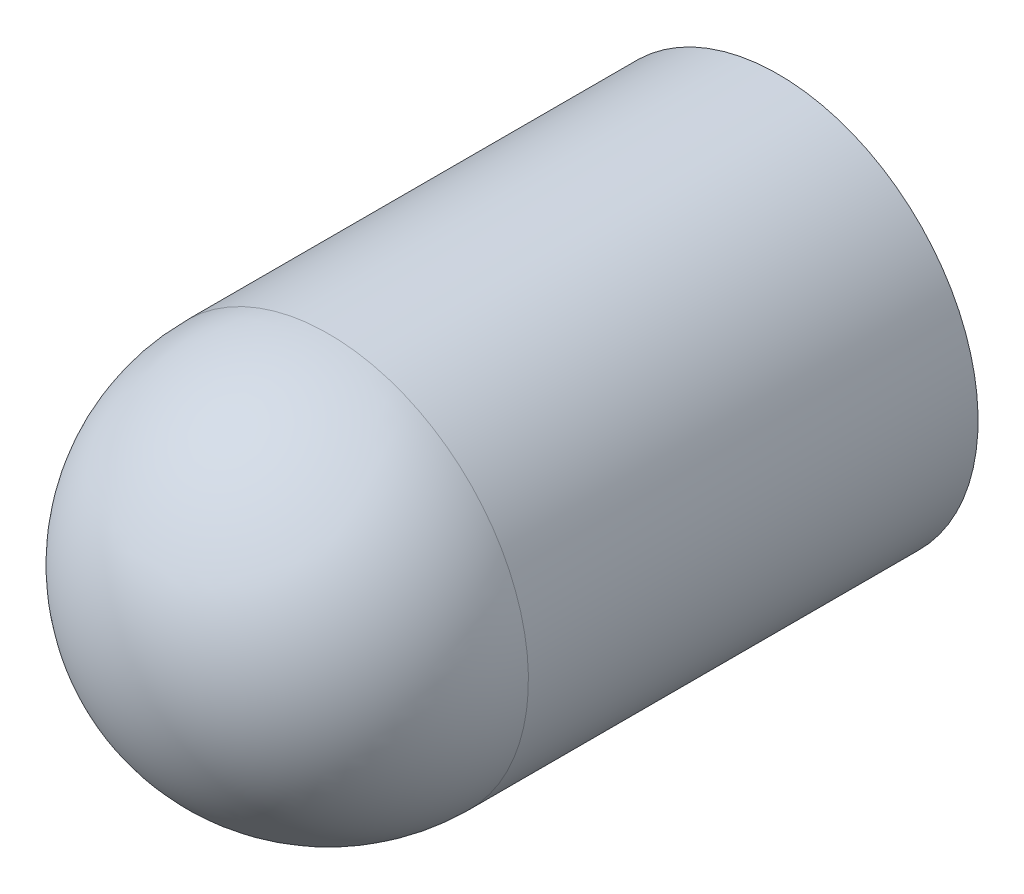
ISO-10303-21;
HEADER;
FILE_DESCRIPTION(('STEP AP214'),'2;1');
FILE_NAME('part.step','',(''),(''),'','','');
FILE_SCHEMA(('AUTOMOTIVE_DESIGN { 1 0 10303 214 1 1 1 1 }'));
ENDSEC;
DATA;
#1=APPLICATION_CONTEXT('core data for automotive mechanical design processes');
#2=APPLICATION_PROTOCOL_DEFINITION('international standard','automotive_design',2000,#1);
#3=PRODUCT_CONTEXT('',#1,'mechanical');
#4=PRODUCT('Part','Part','',(#3));
#5=PRODUCT_RELATED_PRODUCT_CATEGORY('part','',(#4));
#6=PRODUCT_DEFINITION_FORMATION('','',#4);
#7=PRODUCT_DEFINITION_CONTEXT('part definition',#1,'design');
#8=PRODUCT_DEFINITION('design','',#6,#7);
#9=PRODUCT_DEFINITION_SHAPE('','',#8);
#10=(LENGTH_UNIT() NAMED_UNIT(*) SI_UNIT(.MILLI.,.METRE.));
#11=(NAMED_UNIT(*) PLANE_ANGLE_UNIT() SI_UNIT($,.RADIAN.));
#12=(NAMED_UNIT(*) SI_UNIT($,.STERADIAN.) SOLID_ANGLE_UNIT());
#13=UNCERTAINTY_MEASURE_WITH_UNIT(LENGTH_MEASURE(1.E-05),#10,'distance_accuracy_value','');
#14=(GEOMETRIC_REPRESENTATION_CONTEXT(3) GLOBAL_UNCERTAINTY_ASSIGNED_CONTEXT((#13)) GLOBAL_UNIT_ASSIGNED_CONTEXT((#10,
#11,#12)) REPRESENTATION_CONTEXT('',''));
#15=CARTESIAN_POINT('',(0.,0.,0.));
#16=DIRECTION('',(0.,0.,1.));
#17=DIRECTION('',(1.,0.,0.));
#18=AXIS2_PLACEMENT_3D('',#15,#16,#17);
#19=CARTESIAN_POINT('',(0.,0.,7.12));
#20=DIRECTION('',(0.,0.,-1.));
#21=DIRECTION('',(-0.500084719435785,0.865976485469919,0.));
#22=AXIS2_PLACEMENT_3D('',#19,#20,#21);
#23=CYLINDRICAL_SURFACE('',#22,4.);
#24=CARTESIAN_POINT('',(0.,0.,3.12));
#25=DIRECTION('',(0.,0.,1.));
#26=DIRECTION('',(-0.500084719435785,0.865976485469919,0.));
#27=AXIS2_PLACEMENT_3D('',#24,#25,#26);
#28=CIRCLE('',#27,4.);
#29=CARTESIAN_POINT('',(-2.00033887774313,3.46390594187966,3.12));
#30=VERTEX_POINT('',#29);
#31=EDGE_CURVE('E10',#30,#30,#28,.T.);
#32=ORIENTED_EDGE('',*,*,#31,.F.);
#33=EDGE_LOOP('',(#32));
#34=FACE_BOUND('',#33,.T.);
#35=CARTESIAN_POINT('',(0.,0.,-5.88));
#36=DIRECTION('',(0.,0.,1.));
#37=DIRECTION('',(-0.500084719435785,0.865976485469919,0.));
#38=AXIS2_PLACEMENT_3D('',#35,#36,#37);
#39=CIRCLE('',#38,4.);
#40=CARTESIAN_POINT('',(-2.00033887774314,3.46390594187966,-5.88));
#41=VERTEX_POINT('',#40);
#42=EDGE_CURVE('E52',#41,#41,#39,.T.);
#43=ORIENTED_EDGE('',*,*,#42,.T.);
#44=EDGE_LOOP('',(#43));
#45=FACE_BOUND('',#44,.T.);
#46=ADVANCED_FACE('F15',(#34,#45),#23,.T.);
#47=CARTESIAN_POINT('',(0.,0.,3.12));
#48=DIRECTION('',(0.,0.,1.));
#49=DIRECTION('',(0.500084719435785,-0.865976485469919,0.));
#50=AXIS2_PLACEMENT_3D('',#47,#48,#49);
#51=SPHERICAL_SURFACE('',#50,4.);
#52=ORIENTED_EDGE('',*,*,#31,.T.);
#53=EDGE_LOOP('',(#52));
#54=FACE_BOUND('',#53,.T.);
#55=ADVANCED_FACE('F17',(#54),#51,.T.);
#56=CARTESIAN_POINT('',(0.,0.,-5.88));
#57=DIRECTION('',(0.,0.,-1.));
#58=DIRECTION('',(0.500084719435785,-0.865976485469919,0.));
#59=AXIS2_PLACEMENT_3D('',#56,#57,#58);
#60=CYLINDRICAL_SURFACE('',#59,2.5);
#61=CARTESIAN_POINT('',(0.,0.,-5.38));
#62=DIRECTION('',(0.,0.,-1.));
#63=DIRECTION('',(-0.500084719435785,0.865976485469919,0.));
#64=AXIS2_PLACEMENT_3D('',#61,#62,#63);
#65=CIRCLE('',#64,2.5);
#66=CARTESIAN_POINT('',(-1.25021179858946,2.1649412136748,-5.38));
#67=VERTEX_POINT('',#66);
#68=EDGE_CURVE('E25',#67,#67,#65,.T.);
#69=ORIENTED_EDGE('',*,*,#68,.T.);
#70=EDGE_LOOP('',(#69));
#71=FACE_BOUND('',#70,.T.);
#72=CARTESIAN_POINT('',(0.,0.,3.12));
#73=DIRECTION('',(0.,0.,1.));
#74=DIRECTION('',(-0.500084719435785,0.865976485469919,0.));
#75=AXIS2_PLACEMENT_3D('',#72,#73,#74);
#76=CIRCLE('',#75,2.5);
#77=CARTESIAN_POINT('',(-1.25021179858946,2.1649412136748,3.12));
#78=VERTEX_POINT('',#77);
#79=EDGE_CURVE('E63',#78,#78,#76,.T.);
#80=ORIENTED_EDGE('',*,*,#79,.T.);
#81=EDGE_LOOP('',(#80));
#82=FACE_BOUND('',#81,.T.);
#83=ADVANCED_FACE('F74',(#71,#82),#60,.F.);
#84=CARTESIAN_POINT('',(0.,0.,-5.88));
#85=DIRECTION('',(0.,0.,-1.));
#86=DIRECTION('',(0.500084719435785,-0.865976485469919,0.));
#87=AXIS2_PLACEMENT_3D('',#84,#85,#86);
#88=CONICAL_SURFACE('',#87,3.,0.785398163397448);
#89=ORIENTED_EDGE('',*,*,#68,.F.);
#90=EDGE_LOOP('',(#89));
#91=FACE_BOUND('',#90,.T.);
#92=CARTESIAN_POINT('',(0.,0.,-5.88));
#93=DIRECTION('',(0.,0.,1.));
#94=DIRECTION('',(-0.500084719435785,0.865976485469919,0.));
#95=AXIS2_PLACEMENT_3D('',#92,#93,#94);
#96=CIRCLE('',#95,3.);
#97=CARTESIAN_POINT('',(-1.50025415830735,2.59792945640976,-5.88));
#98=VERTEX_POINT('',#97);
#99=EDGE_CURVE('E58',#98,#98,#96,.T.);
#100=ORIENTED_EDGE('',*,*,#99,.F.);
#101=EDGE_LOOP('',(#100));
#102=FACE_BOUND('',#101,.T.);
#103=ADVANCED_FACE('F77',(#91,#102),#88,.F.);
#104=CARTESIAN_POINT('',(0.,0.,3.12));
#105=DIRECTION('',(0.,0.,-1.));
#106=DIRECTION('',(-0.500084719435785,0.865976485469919,0.));
#107=AXIS2_PLACEMENT_3D('',#104,#105,#106);
#108=CONICAL_SURFACE('',#107,2.5,1.02974425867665);
#109=CARTESIAN_POINT('',(0.,0.,4.6221515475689));
#110=VERTEX_POINT('',#109);
#111=VERTEX_LOOP('',#110);
#112=FACE_BOUND('',#111,.T.);
#113=ORIENTED_EDGE('',*,*,#79,.F.);
#114=EDGE_LOOP('',(#113));
#115=FACE_BOUND('',#114,.T.);
#116=ADVANCED_FACE('F79',(#112,#115),#108,.F.);
#117=CARTESIAN_POINT('',(0.,0.,-5.88));
#118=DIRECTION('',(0.,0.,1.));
#119=DIRECTION('',(-0.500084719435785,0.865976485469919,0.));
#120=AXIS2_PLACEMENT_3D('',#117,#118,#119);
#121=PLANE('',#120);
#122=ORIENTED_EDGE('',*,*,#99,.T.);
#123=EDGE_LOOP('',(#122));
#124=FACE_BOUND('',#123,.T.);
#125=ORIENTED_EDGE('',*,*,#42,.F.);
#126=EDGE_LOOP('',(#125));
#127=FACE_BOUND('',#126,.T.);
#128=ADVANCED_FACE('F59',(#124,#127),#121,.F.);
#129=CLOSED_SHELL('',(#46,#55,#83,#103,#116,#128));
#130=MANIFOLD_SOLID_BREP('B1',#129);
#131=ADVANCED_BREP_SHAPE_REPRESENTATION('',(#18,#130),#14);
#132=SHAPE_DEFINITION_REPRESENTATION(#9,#131);
ENDSEC;
END-ISO-10303-21;
